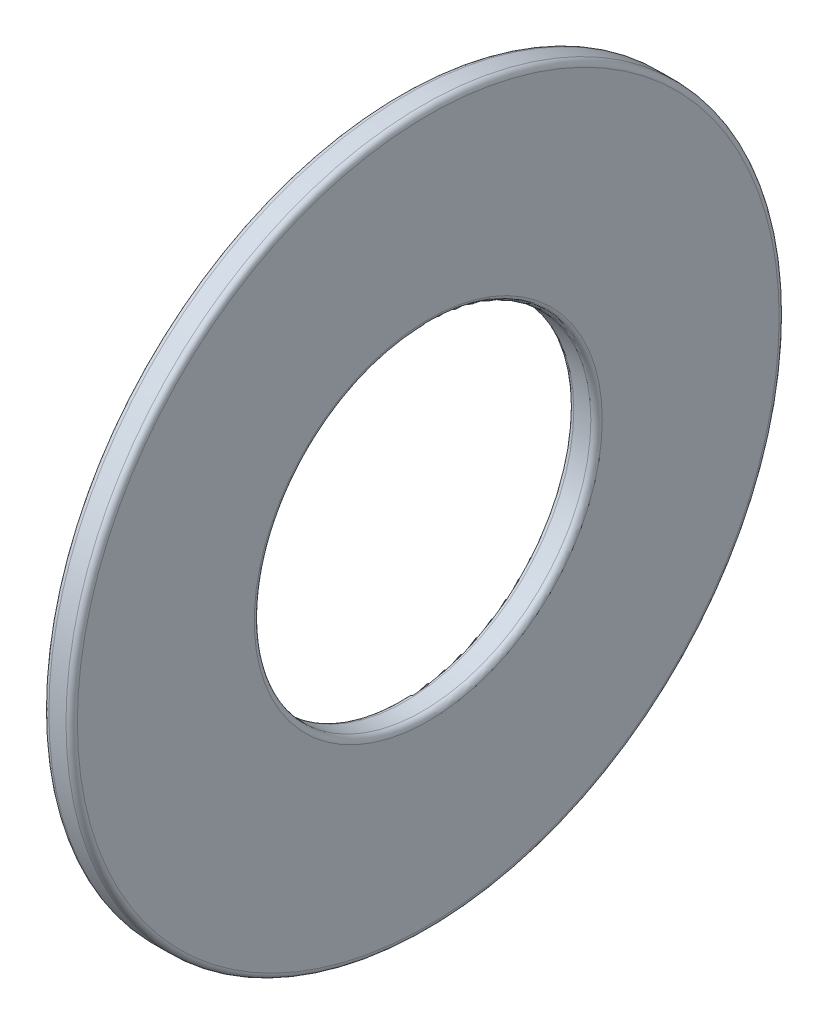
from build123d import *

# Parameters (mm, degrees)
SKETCH1_R           = 28.575
SKETCH1_R_2         = 13.4874
BOSS_EXTRUDE1_DEPTH = 1.143
FILLET1_R           = 0.4572


with BuildPart() as part:
    # Sketch1 → Boss-Extrude1 (new, symmetric)
    with BuildSketch(Plane(origin=(0, 0, 0), x_dir=(0, 0, -1), z_dir=(1, 0, 0))):
        Circle(SKETCH1_R)
        Circle(SKETCH1_R_2, mode=Mode.SUBTRACT)
    extrude(amount=BOSS_EXTRUDE1_DEPTH, both=True)

    # Fillet1
    fillet1_edges = [part.edges().sort_by_distance(p)[0] for p in [
        (-1.143, 0, 28.575),
        (1.143, 0, 28.575),
        (-1.143, 0, 13.4874),
        (1.143, 0, 13.4874),
    ]]
    fillet(fillet1_edges, radius=FILLET1_R)


solid = part.part
